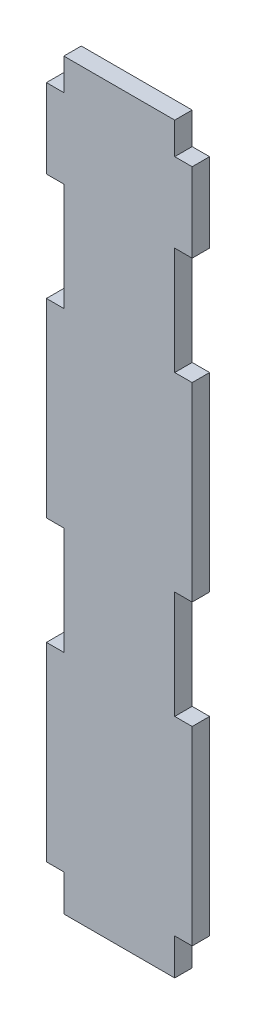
ISO-10303-21;
HEADER;
FILE_DESCRIPTION(('STEP AP214'),'2;1');
FILE_NAME('part.step','',(''),(''),'','','');
FILE_SCHEMA(('AUTOMOTIVE_DESIGN { 1 0 10303 214 1 1 1 1 }'));
ENDSEC;
DATA;
#1=APPLICATION_CONTEXT('core data for automotive mechanical design processes');
#2=APPLICATION_PROTOCOL_DEFINITION('international standard','automotive_design',2000,#1);
#3=PRODUCT_CONTEXT('',#1,'mechanical');
#4=PRODUCT('Part','Part','',(#3));
#5=PRODUCT_RELATED_PRODUCT_CATEGORY('part','',(#4));
#6=PRODUCT_DEFINITION_FORMATION('','',#4);
#7=PRODUCT_DEFINITION_CONTEXT('part definition',#1,'design');
#8=PRODUCT_DEFINITION('design','',#6,#7);
#9=PRODUCT_DEFINITION_SHAPE('','',#8);
#10=(LENGTH_UNIT() NAMED_UNIT(*) SI_UNIT(.MILLI.,.METRE.));
#11=(NAMED_UNIT(*) PLANE_ANGLE_UNIT() SI_UNIT($,.RADIAN.));
#12=(NAMED_UNIT(*) SI_UNIT($,.STERADIAN.) SOLID_ANGLE_UNIT());
#13=UNCERTAINTY_MEASURE_WITH_UNIT(LENGTH_MEASURE(1.E-05),#10,'distance_accuracy_value','');
#14=(GEOMETRIC_REPRESENTATION_CONTEXT(3) GLOBAL_UNCERTAINTY_ASSIGNED_CONTEXT((#13)) GLOBAL_UNIT_ASSIGNED_CONTEXT((#10,
#11,#12)) REPRESENTATION_CONTEXT('',''));
#15=CARTESIAN_POINT('',(0.,0.,0.));
#16=DIRECTION('',(0.,0.,1.));
#17=DIRECTION('',(1.,0.,0.));
#18=AXIS2_PLACEMENT_3D('',#15,#16,#17);
#19=CARTESIAN_POINT('',(17.7551737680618,-117.377586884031,5.5));
#20=DIRECTION('',(0.,1.,0.));
#21=DIRECTION('',(0.,0.,1.));
#22=AXIS2_PLACEMENT_3D('',#19,#20,#21);
#23=PLANE('',#22);
#24=DIRECTION('',(1.,0.,0.));
#25=VECTOR('',#24,1.);
#26=CARTESIAN_POINT('',(17.7551737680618,-117.377586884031,0.));
#27=LINE('',#26,#25);
#28=CARTESIAN_POINT('',(-17.2448262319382,-117.377586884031,0.));
#29=VERTEX_POINT('',#28);
#30=CARTESIAN_POINT('',(17.7551737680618,-117.377586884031,0.));
#31=VERTEX_POINT('',#30);
#32=EDGE_CURVE('E257',#29,#31,#27,.T.);
#33=ORIENTED_EDGE('',*,*,#32,.T.);
#34=DIRECTION('',(0.,0.,-1.));
#35=VECTOR('',#34,1.);
#36=CARTESIAN_POINT('',(17.7551737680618,-117.377586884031,5.5));
#37=LINE('',#36,#35);
#38=CARTESIAN_POINT('',(17.7551737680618,-117.377586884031,5.5));
#39=VERTEX_POINT('',#38);
#40=EDGE_CURVE('E11',#39,#31,#37,.T.);
#41=ORIENTED_EDGE('',*,*,#40,.F.);
#42=DIRECTION('',(1.,0.,0.));
#43=VECTOR('',#42,1.);
#44=CARTESIAN_POINT('',(17.7551737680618,-117.377586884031,5.5));
#45=LINE('',#44,#43);
#46=CARTESIAN_POINT('',(-17.2448262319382,-117.377586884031,5.5));
#47=VERTEX_POINT('',#46);
#48=EDGE_CURVE('E311',#47,#39,#45,.T.);
#49=ORIENTED_EDGE('',*,*,#48,.F.);
#50=DIRECTION('',(0.,0.,-1.));
#51=VECTOR('',#50,1.);
#52=CARTESIAN_POINT('',(-17.2448262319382,-117.377586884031,5.5));
#53=LINE('',#52,#51);
#54=EDGE_CURVE('E253',#47,#29,#53,.T.);
#55=ORIENTED_EDGE('',*,*,#54,.T.);
#56=EDGE_LOOP('',(#33,#41,#49,#55));
#57=FACE_BOUND('',#56,.T.);
#58=ADVANCED_FACE('F41',(#57),#23,.F.);
#59=CARTESIAN_POINT('',(17.7551737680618,-117.377586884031,5.5));
#60=DIRECTION('',(-1.,0.,0.));
#61=DIRECTION('',(0.,0.,1.));
#62=AXIS2_PLACEMENT_3D('',#59,#60,#61);
#63=PLANE('',#62);
#64=DIRECTION('',(0.,1.,0.));
#65=VECTOR('',#64,1.);
#66=CARTESIAN_POINT('',(17.7551737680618,-117.377586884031,0.));
#67=LINE('',#66,#65);
#68=CARTESIAN_POINT('',(17.7551737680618,-105.877586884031,0.));
#69=VERTEX_POINT('',#68);
#70=EDGE_CURVE('E260',#31,#69,#67,.T.);
#71=ORIENTED_EDGE('',*,*,#70,.T.);
#72=DIRECTION('',(0.,0.,-1.));
#73=VECTOR('',#72,1.);
#74=CARTESIAN_POINT('',(17.7551737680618,-105.877586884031,5.5));
#75=LINE('',#74,#73);
#76=CARTESIAN_POINT('',(17.7551737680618,-105.877586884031,5.5));
#77=VERTEX_POINT('',#76);
#78=EDGE_CURVE('E49',#77,#69,#75,.T.);
#79=ORIENTED_EDGE('',*,*,#78,.F.);
#80=DIRECTION('',(0.,1.,0.));
#81=VECTOR('',#80,1.);
#82=CARTESIAN_POINT('',(17.7551737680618,-117.377586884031,5.5));
#83=LINE('',#82,#81);
#84=EDGE_CURVE('E160',#39,#77,#83,.T.);
#85=ORIENTED_EDGE('',*,*,#84,.F.);
#86=ORIENTED_EDGE('',*,*,#40,.T.);
#87=EDGE_LOOP('',(#71,#79,#85,#86));
#88=FACE_BOUND('',#87,.T.);
#89=ADVANCED_FACE('F469',(#88),#63,.F.);
#90=CARTESIAN_POINT('',(23.2551737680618,-105.877586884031,5.5));
#91=DIRECTION('',(0.,1.,0.));
#92=DIRECTION('',(0.,0.,1.));
#93=AXIS2_PLACEMENT_3D('',#90,#91,#92);
#94=PLANE('',#93);
#95=DIRECTION('',(1.,0.,0.));
#96=VECTOR('',#95,1.);
#97=CARTESIAN_POINT('',(23.2551737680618,-105.877586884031,0.));
#98=LINE('',#97,#96);
#99=CARTESIAN_POINT('',(23.2551737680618,-105.877586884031,0.));
#100=VERTEX_POINT('',#99);
#101=EDGE_CURVE('E262',#69,#100,#98,.T.);
#102=ORIENTED_EDGE('',*,*,#101,.T.);
#103=DIRECTION('',(0.,0.,-1.));
#104=VECTOR('',#103,1.);
#105=CARTESIAN_POINT('',(23.2551737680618,-105.877586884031,5.5));
#106=LINE('',#105,#104);
#107=CARTESIAN_POINT('',(23.2551737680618,-105.877586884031,5.5));
#108=VERTEX_POINT('',#107);
#109=EDGE_CURVE('E378',#108,#100,#106,.T.);
#110=ORIENTED_EDGE('',*,*,#109,.F.);
#111=DIRECTION('',(1.,0.,0.));
#112=VECTOR('',#111,1.);
#113=CARTESIAN_POINT('',(23.2551737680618,-105.877586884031,5.5));
#114=LINE('',#113,#112);
#115=EDGE_CURVE('E386',#77,#108,#114,.T.);
#116=ORIENTED_EDGE('',*,*,#115,.F.);
#117=ORIENTED_EDGE('',*,*,#78,.T.);
#118=EDGE_LOOP('',(#102,#110,#116,#117));
#119=FACE_BOUND('',#118,.T.);
#120=ADVANCED_FACE('F384',(#119),#94,.F.);
#121=CARTESIAN_POINT('',(23.2551737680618,-45.8775868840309,5.5));
#122=DIRECTION('',(-1.,0.,0.));
#123=DIRECTION('',(0.,0.,1.));
#124=AXIS2_PLACEMENT_3D('',#121,#122,#123);
#125=PLANE('',#124);
#126=DIRECTION('',(0.,1.,0.));
#127=VECTOR('',#126,1.);
#128=CARTESIAN_POINT('',(23.2551737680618,-45.8775868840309,0.));
#129=LINE('',#128,#127);
#130=CARTESIAN_POINT('',(23.2551737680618,-45.8775868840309,0.));
#131=VERTEX_POINT('',#130);
#132=EDGE_CURVE('E264',#100,#131,#129,.T.);
#133=ORIENTED_EDGE('',*,*,#132,.T.);
#134=DIRECTION('',(0.,0.,-1.));
#135=VECTOR('',#134,1.);
#136=CARTESIAN_POINT('',(23.2551737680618,-45.8775868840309,5.5));
#137=LINE('',#136,#135);
#138=CARTESIAN_POINT('',(23.2551737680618,-45.8775868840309,5.5));
#139=VERTEX_POINT('',#138);
#140=EDGE_CURVE('E375',#139,#131,#137,.T.);
#141=ORIENTED_EDGE('',*,*,#140,.F.);
#142=DIRECTION('',(0.,1.,0.));
#143=VECTOR('',#142,1.);
#144=CARTESIAN_POINT('',(23.2551737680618,-45.8775868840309,5.5));
#145=LINE('',#144,#143);
#146=EDGE_CURVE('E404',#108,#139,#145,.T.);
#147=ORIENTED_EDGE('',*,*,#146,.F.);
#148=ORIENTED_EDGE('',*,*,#109,.T.);
#149=EDGE_LOOP('',(#133,#141,#147,#148));
#150=FACE_BOUND('',#149,.T.);
#151=ADVANCED_FACE('F395',(#150),#125,.F.);
#152=CARTESIAN_POINT('',(17.7551737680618,-45.8775868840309,5.5));
#153=DIRECTION('',(0.,-1.,0.));
#154=DIRECTION('',(0.,0.,-1.));
#155=AXIS2_PLACEMENT_3D('',#152,#153,#154);
#156=PLANE('',#155);
#157=DIRECTION('',(-1.,0.,0.));
#158=VECTOR('',#157,1.);
#159=CARTESIAN_POINT('',(17.7551737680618,-45.8775868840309,0.));
#160=LINE('',#159,#158);
#161=CARTESIAN_POINT('',(17.7551737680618,-45.8775868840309,0.));
#162=VERTEX_POINT('',#161);
#163=EDGE_CURVE('E266',#131,#162,#160,.T.);
#164=ORIENTED_EDGE('',*,*,#163,.T.);
#165=DIRECTION('',(0.,0.,-1.));
#166=VECTOR('',#165,1.);
#167=CARTESIAN_POINT('',(17.7551737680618,-45.8775868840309,5.5));
#168=LINE('',#167,#166);
#169=CARTESIAN_POINT('',(17.7551737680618,-45.8775868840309,5.5));
#170=VERTEX_POINT('',#169);
#171=EDGE_CURVE('E372',#170,#162,#168,.T.);
#172=ORIENTED_EDGE('',*,*,#171,.F.);
#173=DIRECTION('',(-1.,0.,0.));
#174=VECTOR('',#173,1.);
#175=CARTESIAN_POINT('',(17.7551737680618,-45.8775868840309,5.5));
#176=LINE('',#175,#174);
#177=EDGE_CURVE('E401',#139,#170,#176,.T.);
#178=ORIENTED_EDGE('',*,*,#177,.F.);
#179=ORIENTED_EDGE('',*,*,#140,.T.);
#180=EDGE_LOOP('',(#164,#172,#178,#179));
#181=FACE_BOUND('',#180,.T.);
#182=ADVANCED_FACE('F399',(#181),#156,.F.);
#183=CARTESIAN_POINT('',(17.7551737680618,-45.8775868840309,5.5));
#184=DIRECTION('',(-1.,0.,0.));
#185=DIRECTION('',(0.,0.,1.));
#186=AXIS2_PLACEMENT_3D('',#183,#184,#185);
#187=PLANE('',#186);
#188=DIRECTION('',(0.,1.,0.));
#189=VECTOR('',#188,1.);
#190=CARTESIAN_POINT('',(17.7551737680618,-45.8775868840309,0.));
#191=LINE('',#190,#189);
#192=CARTESIAN_POINT('',(17.7551737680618,-11.8775868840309,0.));
#193=VERTEX_POINT('',#192);
#194=EDGE_CURVE('E268',#162,#193,#191,.T.);
#195=ORIENTED_EDGE('',*,*,#194,.T.);
#196=DIRECTION('',(0.,0.,-1.));
#197=VECTOR('',#196,1.);
#198=CARTESIAN_POINT('',(17.7551737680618,-11.8775868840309,5.5));
#199=LINE('',#198,#197);
#200=CARTESIAN_POINT('',(17.7551737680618,-11.8775868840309,5.5));
#201=VERTEX_POINT('',#200);
#202=EDGE_CURVE('E369',#201,#193,#199,.T.);
#203=ORIENTED_EDGE('',*,*,#202,.F.);
#204=DIRECTION('',(0.,1.,0.));
#205=VECTOR('',#204,1.);
#206=CARTESIAN_POINT('',(17.7551737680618,-45.8775868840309,5.5));
#207=LINE('',#206,#205);
#208=EDGE_CURVE('E403',#170,#201,#207,.T.);
#209=ORIENTED_EDGE('',*,*,#208,.F.);
#210=ORIENTED_EDGE('',*,*,#171,.T.);
#211=EDGE_LOOP('',(#195,#203,#209,#210));
#212=FACE_BOUND('',#211,.T.);
#213=ADVANCED_FACE('F482',(#212),#187,.F.);
#214=CARTESIAN_POINT('',(23.2551737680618,-11.8775868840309,5.5));
#215=DIRECTION('',(0.,1.,0.));
#216=DIRECTION('',(0.,0.,1.));
#217=AXIS2_PLACEMENT_3D('',#214,#215,#216);
#218=PLANE('',#217);
#219=DIRECTION('',(1.,0.,0.));
#220=VECTOR('',#219,1.);
#221=CARTESIAN_POINT('',(23.2551737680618,-11.8775868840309,0.));
#222=LINE('',#221,#220);
#223=CARTESIAN_POINT('',(23.2551737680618,-11.8775868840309,0.));
#224=VERTEX_POINT('',#223);
#225=EDGE_CURVE('E270',#193,#224,#222,.T.);
#226=ORIENTED_EDGE('',*,*,#225,.T.);
#227=DIRECTION('',(0.,0.,-1.));
#228=VECTOR('',#227,1.);
#229=CARTESIAN_POINT('',(23.2551737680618,-11.8775868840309,5.5));
#230=LINE('',#229,#228);
#231=CARTESIAN_POINT('',(23.2551737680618,-11.8775868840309,5.5));
#232=VERTEX_POINT('',#231);
#233=EDGE_CURVE('E366',#232,#224,#230,.T.);
#234=ORIENTED_EDGE('',*,*,#233,.F.);
#235=DIRECTION('',(1.,0.,0.));
#236=VECTOR('',#235,1.);
#237=CARTESIAN_POINT('',(23.2551737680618,-11.8775868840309,5.5));
#238=LINE('',#237,#236);
#239=EDGE_CURVE('E406',#201,#232,#238,.T.);
#240=ORIENTED_EDGE('',*,*,#239,.F.);
#241=ORIENTED_EDGE('',*,*,#202,.T.);
#242=EDGE_LOOP('',(#226,#234,#240,#241));
#243=FACE_BOUND('',#242,.T.);
#244=ADVANCED_FACE('F485',(#243),#218,.F.);
#245=CARTESIAN_POINT('',(23.2551737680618,48.1224131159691,5.5));
#246=DIRECTION('',(-1.,0.,0.));
#247=DIRECTION('',(0.,0.,1.));
#248=AXIS2_PLACEMENT_3D('',#245,#246,#247);
#249=PLANE('',#248);
#250=DIRECTION('',(0.,1.,0.));
#251=VECTOR('',#250,1.);
#252=CARTESIAN_POINT('',(23.2551737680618,48.1224131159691,0.));
#253=LINE('',#252,#251);
#254=CARTESIAN_POINT('',(23.2551737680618,48.1224131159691,0.));
#255=VERTEX_POINT('',#254);
#256=EDGE_CURVE('E272',#224,#255,#253,.T.);
#257=ORIENTED_EDGE('',*,*,#256,.T.);
#258=DIRECTION('',(0.,0.,-1.));
#259=VECTOR('',#258,1.);
#260=CARTESIAN_POINT('',(23.2551737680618,48.1224131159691,5.5));
#261=LINE('',#260,#259);
#262=CARTESIAN_POINT('',(23.2551737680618,48.1224131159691,5.5));
#263=VERTEX_POINT('',#262);
#264=EDGE_CURVE('E363',#263,#255,#261,.T.);
#265=ORIENTED_EDGE('',*,*,#264,.F.);
#266=DIRECTION('',(0.,1.,0.));
#267=VECTOR('',#266,1.);
#268=CARTESIAN_POINT('',(23.2551737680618,48.1224131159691,5.5));
#269=LINE('',#268,#267);
#270=EDGE_CURVE('E412',#232,#263,#269,.T.);
#271=ORIENTED_EDGE('',*,*,#270,.F.);
#272=ORIENTED_EDGE('',*,*,#233,.T.);
#273=EDGE_LOOP('',(#257,#265,#271,#272));
#274=FACE_BOUND('',#273,.T.);
#275=ADVANCED_FACE('F489',(#274),#249,.F.);
#276=CARTESIAN_POINT('',(17.7551737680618,48.1224131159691,5.5));
#277=DIRECTION('',(0.,-1.,0.));
#278=DIRECTION('',(0.,0.,-1.));
#279=AXIS2_PLACEMENT_3D('',#276,#277,#278);
#280=PLANE('',#279);
#281=DIRECTION('',(-1.,0.,0.));
#282=VECTOR('',#281,1.);
#283=CARTESIAN_POINT('',(17.7551737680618,48.1224131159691,0.));
#284=LINE('',#283,#282);
#285=CARTESIAN_POINT('',(17.7551737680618,48.1224131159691,0.));
#286=VERTEX_POINT('',#285);
#287=EDGE_CURVE('E274',#255,#286,#284,.T.);
#288=ORIENTED_EDGE('',*,*,#287,.T.);
#289=DIRECTION('',(0.,0.,-1.));
#290=VECTOR('',#289,1.);
#291=CARTESIAN_POINT('',(17.7551737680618,48.1224131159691,5.5));
#292=LINE('',#291,#290);
#293=CARTESIAN_POINT('',(17.7551737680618,48.1224131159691,5.5));
#294=VERTEX_POINT('',#293);
#295=EDGE_CURVE('E360',#294,#286,#292,.T.);
#296=ORIENTED_EDGE('',*,*,#295,.F.);
#297=DIRECTION('',(-1.,0.,0.));
#298=VECTOR('',#297,1.);
#299=CARTESIAN_POINT('',(17.7551737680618,48.1224131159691,5.5));
#300=LINE('',#299,#298);
#301=EDGE_CURVE('E414',#263,#294,#300,.T.);
#302=ORIENTED_EDGE('',*,*,#301,.F.);
#303=ORIENTED_EDGE('',*,*,#264,.T.);
#304=EDGE_LOOP('',(#288,#296,#302,#303));
#305=FACE_BOUND('',#304,.T.);
#306=ADVANCED_FACE('F493',(#305),#280,.F.);
#307=CARTESIAN_POINT('',(17.7551737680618,82.1224131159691,5.5));
#308=DIRECTION('',(-1.,0.,0.));
#309=DIRECTION('',(0.,0.,1.));
#310=AXIS2_PLACEMENT_3D('',#307,#308,#309);
#311=PLANE('',#310);
#312=DIRECTION('',(0.,1.,0.));
#313=VECTOR('',#312,1.);
#314=CARTESIAN_POINT('',(17.7551737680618,82.1224131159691,0.));
#315=LINE('',#314,#313);
#316=CARTESIAN_POINT('',(17.7551737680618,82.1224131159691,0.));
#317=VERTEX_POINT('',#316);
#318=EDGE_CURVE('E276',#286,#317,#315,.T.);
#319=ORIENTED_EDGE('',*,*,#318,.T.);
#320=DIRECTION('',(0.,0.,-1.));
#321=VECTOR('',#320,1.);
#322=CARTESIAN_POINT('',(17.7551737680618,82.1224131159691,5.5));
#323=LINE('',#322,#321);
#324=CARTESIAN_POINT('',(17.7551737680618,82.1224131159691,5.5));
#325=VERTEX_POINT('',#324);
#326=EDGE_CURVE('E357',#325,#317,#323,.T.);
#327=ORIENTED_EDGE('',*,*,#326,.F.);
#328=DIRECTION('',(0.,1.,0.));
#329=VECTOR('',#328,1.);
#330=CARTESIAN_POINT('',(17.7551737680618,82.1224131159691,5.5));
#331=LINE('',#330,#329);
#332=EDGE_CURVE('E416',#294,#325,#331,.T.);
#333=ORIENTED_EDGE('',*,*,#332,.F.);
#334=ORIENTED_EDGE('',*,*,#295,.T.);
#335=EDGE_LOOP('',(#319,#327,#333,#334));
#336=FACE_BOUND('',#335,.T.);
#337=ADVANCED_FACE('F497',(#336),#311,.F.);
#338=CARTESIAN_POINT('',(23.2551737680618,82.1224131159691,5.5));
#339=DIRECTION('',(0.,1.,0.));
#340=DIRECTION('',(0.,0.,1.));
#341=AXIS2_PLACEMENT_3D('',#338,#339,#340);
#342=PLANE('',#341);
#343=DIRECTION('',(1.,0.,0.));
#344=VECTOR('',#343,1.);
#345=CARTESIAN_POINT('',(23.2551737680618,82.1224131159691,0.));
#346=LINE('',#345,#344);
#347=CARTESIAN_POINT('',(23.2551737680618,82.1224131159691,0.));
#348=VERTEX_POINT('',#347);
#349=EDGE_CURVE('E278',#317,#348,#346,.T.);
#350=ORIENTED_EDGE('',*,*,#349,.T.);
#351=DIRECTION('',(0.,0.,-1.));
#352=VECTOR('',#351,1.);
#353=CARTESIAN_POINT('',(23.2551737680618,82.1224131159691,5.5));
#354=LINE('',#353,#352);
#355=CARTESIAN_POINT('',(23.2551737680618,82.1224131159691,5.5));
#356=VERTEX_POINT('',#355);
#357=EDGE_CURVE('E354',#356,#348,#354,.T.);
#358=ORIENTED_EDGE('',*,*,#357,.F.);
#359=DIRECTION('',(1.,0.,0.));
#360=VECTOR('',#359,1.);
#361=CARTESIAN_POINT('',(23.2551737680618,82.1224131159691,5.5));
#362=LINE('',#361,#360);
#363=EDGE_CURVE('E418',#325,#356,#362,.T.);
#364=ORIENTED_EDGE('',*,*,#363,.F.);
#365=ORIENTED_EDGE('',*,*,#326,.T.);
#366=EDGE_LOOP('',(#350,#358,#364,#365));
#367=FACE_BOUND('',#366,.T.);
#368=ADVANCED_FACE('F501',(#367),#342,.F.);
#369=CARTESIAN_POINT('',(23.2551737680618,107.122413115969,5.5));
#370=DIRECTION('',(-1.,0.,0.));
#371=DIRECTION('',(0.,0.,1.));
#372=AXIS2_PLACEMENT_3D('',#369,#370,#371);
#373=PLANE('',#372);
#374=DIRECTION('',(0.,1.,0.));
#375=VECTOR('',#374,1.);
#376=CARTESIAN_POINT('',(23.2551737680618,107.122413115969,0.));
#377=LINE('',#376,#375);
#378=CARTESIAN_POINT('',(23.2551737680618,107.122413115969,0.));
#379=VERTEX_POINT('',#378);
#380=EDGE_CURVE('E280',#348,#379,#377,.T.);
#381=ORIENTED_EDGE('',*,*,#380,.T.);
#382=DIRECTION('',(0.,0.,-1.));
#383=VECTOR('',#382,1.);
#384=CARTESIAN_POINT('',(23.2551737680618,107.122413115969,5.5));
#385=LINE('',#384,#383);
#386=CARTESIAN_POINT('',(23.2551737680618,107.122413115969,5.5));
#387=VERTEX_POINT('',#386);
#388=EDGE_CURVE('E351',#387,#379,#385,.T.);
#389=ORIENTED_EDGE('',*,*,#388,.F.);
#390=DIRECTION('',(0.,1.,0.));
#391=VECTOR('',#390,1.);
#392=CARTESIAN_POINT('',(23.2551737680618,107.122413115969,5.5));
#393=LINE('',#392,#391);
#394=EDGE_CURVE('E420',#356,#387,#393,.T.);
#395=ORIENTED_EDGE('',*,*,#394,.F.);
#396=ORIENTED_EDGE('',*,*,#357,.T.);
#397=EDGE_LOOP('',(#381,#389,#395,#396));
#398=FACE_BOUND('',#397,.T.);
#399=ADVANCED_FACE('F505',(#398),#373,.F.);
#400=CARTESIAN_POINT('',(17.7551737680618,107.122413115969,5.5));
#401=DIRECTION('',(0.,-1.,0.));
#402=DIRECTION('',(0.,0.,-1.));
#403=AXIS2_PLACEMENT_3D('',#400,#401,#402);
#404=PLANE('',#403);
#405=DIRECTION('',(-1.,0.,0.));
#406=VECTOR('',#405,1.);
#407=CARTESIAN_POINT('',(17.7551737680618,107.122413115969,0.));
#408=LINE('',#407,#406);
#409=CARTESIAN_POINT('',(17.7551737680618,107.122413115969,0.));
#410=VERTEX_POINT('',#409);
#411=EDGE_CURVE('E282',#379,#410,#408,.T.);
#412=ORIENTED_EDGE('',*,*,#411,.T.);
#413=DIRECTION('',(0.,0.,-1.));
#414=VECTOR('',#413,1.);
#415=CARTESIAN_POINT('',(17.7551737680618,107.122413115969,5.5));
#416=LINE('',#415,#414);
#417=CARTESIAN_POINT('',(17.7551737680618,107.122413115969,5.5));
#418=VERTEX_POINT('',#417);
#419=EDGE_CURVE('E348',#418,#410,#416,.T.);
#420=ORIENTED_EDGE('',*,*,#419,.F.);
#421=DIRECTION('',(-1.,0.,0.));
#422=VECTOR('',#421,1.);
#423=CARTESIAN_POINT('',(17.7551737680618,107.122413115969,5.5));
#424=LINE('',#423,#422);
#425=EDGE_CURVE('E422',#387,#418,#424,.T.);
#426=ORIENTED_EDGE('',*,*,#425,.F.);
#427=ORIENTED_EDGE('',*,*,#388,.T.);
#428=EDGE_LOOP('',(#412,#420,#426,#427));
#429=FACE_BOUND('',#428,.T.);
#430=ADVANCED_FACE('F509',(#429),#404,.F.);
#431=CARTESIAN_POINT('',(17.7551737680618,117.122413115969,5.5));
#432=DIRECTION('',(-1.,0.,0.));
#433=DIRECTION('',(0.,0.,1.));
#434=AXIS2_PLACEMENT_3D('',#431,#432,#433);
#435=PLANE('',#434);
#436=DIRECTION('',(0.,1.,0.));
#437=VECTOR('',#436,1.);
#438=CARTESIAN_POINT('',(17.7551737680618,117.122413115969,0.));
#439=LINE('',#438,#437);
#440=CARTESIAN_POINT('',(17.7551737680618,117.122413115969,0.));
#441=VERTEX_POINT('',#440);
#442=EDGE_CURVE('E284',#410,#441,#439,.T.);
#443=ORIENTED_EDGE('',*,*,#442,.T.);
#444=DIRECTION('',(0.,0.,-1.));
#445=VECTOR('',#444,1.);
#446=CARTESIAN_POINT('',(17.7551737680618,117.122413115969,5.5));
#447=LINE('',#446,#445);
#448=CARTESIAN_POINT('',(17.7551737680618,117.122413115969,5.5));
#449=VERTEX_POINT('',#448);
#450=EDGE_CURVE('E345',#449,#441,#447,.T.);
#451=ORIENTED_EDGE('',*,*,#450,.F.);
#452=DIRECTION('',(0.,1.,0.));
#453=VECTOR('',#452,1.);
#454=CARTESIAN_POINT('',(17.7551737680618,117.122413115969,5.5));
#455=LINE('',#454,#453);
#456=EDGE_CURVE('E424',#418,#449,#455,.T.);
#457=ORIENTED_EDGE('',*,*,#456,.F.);
#458=ORIENTED_EDGE('',*,*,#419,.T.);
#459=EDGE_LOOP('',(#443,#451,#457,#458));
#460=FACE_BOUND('',#459,.T.);
#461=ADVANCED_FACE('F513',(#460),#435,.F.);
#462=CARTESIAN_POINT('',(-17.2448262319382,117.122413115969,5.5));
#463=DIRECTION('',(0.,-1.,0.));
#464=DIRECTION('',(0.,0.,-1.));
#465=AXIS2_PLACEMENT_3D('',#462,#463,#464);
#466=PLANE('',#465);
#467=DIRECTION('',(-1.,0.,0.));
#468=VECTOR('',#467,1.);
#469=CARTESIAN_POINT('',(-17.2448262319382,117.122413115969,0.));
#470=LINE('',#469,#468);
#471=CARTESIAN_POINT('',(-17.2448262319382,117.122413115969,0.));
#472=VERTEX_POINT('',#471);
#473=EDGE_CURVE('E286',#441,#472,#470,.T.);
#474=ORIENTED_EDGE('',*,*,#473,.T.);
#475=DIRECTION('',(0.,0.,-1.));
#476=VECTOR('',#475,1.);
#477=CARTESIAN_POINT('',(-17.2448262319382,117.122413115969,5.5));
#478=LINE('',#477,#476);
#479=CARTESIAN_POINT('',(-17.2448262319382,117.122413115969,5.5));
#480=VERTEX_POINT('',#479);
#481=EDGE_CURVE('E342',#480,#472,#478,.T.);
#482=ORIENTED_EDGE('',*,*,#481,.F.);
#483=DIRECTION('',(-1.,0.,0.));
#484=VECTOR('',#483,1.);
#485=CARTESIAN_POINT('',(-17.2448262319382,117.122413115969,5.5));
#486=LINE('',#485,#484);
#487=EDGE_CURVE('E426',#449,#480,#486,.T.);
#488=ORIENTED_EDGE('',*,*,#487,.F.);
#489=ORIENTED_EDGE('',*,*,#450,.T.);
#490=EDGE_LOOP('',(#474,#482,#488,#489));
#491=FACE_BOUND('',#490,.T.);
#492=ADVANCED_FACE('F517',(#491),#466,.F.);
#493=CARTESIAN_POINT('',(-17.2448262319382,107.122413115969,5.5));
#494=DIRECTION('',(1.,0.,0.));
#495=DIRECTION('',(0.,0.,-1.));
#496=AXIS2_PLACEMENT_3D('',#493,#494,#495);
#497=PLANE('',#496);
#498=DIRECTION('',(0.,-1.,0.));
#499=VECTOR('',#498,1.);
#500=CARTESIAN_POINT('',(-17.2448262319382,107.122413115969,0.));
#501=LINE('',#500,#499);
#502=CARTESIAN_POINT('',(-17.2448262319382,107.122413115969,0.));
#503=VERTEX_POINT('',#502);
#504=EDGE_CURVE('E288',#472,#503,#501,.T.);
#505=ORIENTED_EDGE('',*,*,#504,.T.);
#506=DIRECTION('',(0.,0.,-1.));
#507=VECTOR('',#506,1.);
#508=CARTESIAN_POINT('',(-17.2448262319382,107.122413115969,5.5));
#509=LINE('',#508,#507);
#510=CARTESIAN_POINT('',(-17.2448262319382,107.122413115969,5.5));
#511=VERTEX_POINT('',#510);
#512=EDGE_CURVE('E339',#511,#503,#509,.T.);
#513=ORIENTED_EDGE('',*,*,#512,.F.);
#514=DIRECTION('',(0.,-1.,0.));
#515=VECTOR('',#514,1.);
#516=CARTESIAN_POINT('',(-17.2448262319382,107.122413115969,5.5));
#517=LINE('',#516,#515);
#518=EDGE_CURVE('E428',#480,#511,#517,.T.);
#519=ORIENTED_EDGE('',*,*,#518,.F.);
#520=ORIENTED_EDGE('',*,*,#481,.T.);
#521=EDGE_LOOP('',(#505,#513,#519,#520));
#522=FACE_BOUND('',#521,.T.);
#523=ADVANCED_FACE('F521',(#522),#497,.F.);
#524=CARTESIAN_POINT('',(-22.7448262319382,107.122413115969,5.5));
#525=DIRECTION('',(0.,-1.,0.));
#526=DIRECTION('',(0.,0.,-1.));
#527=AXIS2_PLACEMENT_3D('',#524,#525,#526);
#528=PLANE('',#527);
#529=DIRECTION('',(-1.,0.,0.));
#530=VECTOR('',#529,1.);
#531=CARTESIAN_POINT('',(-22.7448262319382,107.122413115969,0.));
#532=LINE('',#531,#530);
#533=CARTESIAN_POINT('',(-22.7448262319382,107.122413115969,0.));
#534=VERTEX_POINT('',#533);
#535=EDGE_CURVE('E290',#503,#534,#532,.T.);
#536=ORIENTED_EDGE('',*,*,#535,.T.);
#537=DIRECTION('',(0.,0.,-1.));
#538=VECTOR('',#537,1.);
#539=CARTESIAN_POINT('',(-22.7448262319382,107.122413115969,5.5));
#540=LINE('',#539,#538);
#541=CARTESIAN_POINT('',(-22.7448262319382,107.122413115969,5.5));
#542=VERTEX_POINT('',#541);
#543=EDGE_CURVE('E336',#542,#534,#540,.T.);
#544=ORIENTED_EDGE('',*,*,#543,.F.);
#545=DIRECTION('',(-1.,0.,0.));
#546=VECTOR('',#545,1.);
#547=CARTESIAN_POINT('',(-22.7448262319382,107.122413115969,5.5));
#548=LINE('',#547,#546);
#549=EDGE_CURVE('E430',#511,#542,#548,.T.);
#550=ORIENTED_EDGE('',*,*,#549,.F.);
#551=ORIENTED_EDGE('',*,*,#512,.T.);
#552=EDGE_LOOP('',(#536,#544,#550,#551));
#553=FACE_BOUND('',#552,.T.);
#554=ADVANCED_FACE('F525',(#553),#528,.F.);
#555=CARTESIAN_POINT('',(-22.7448262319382,82.1224131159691,5.5));
#556=DIRECTION('',(1.,0.,0.));
#557=DIRECTION('',(0.,0.,-1.));
#558=AXIS2_PLACEMENT_3D('',#555,#556,#557);
#559=PLANE('',#558);
#560=DIRECTION('',(0.,-1.,0.));
#561=VECTOR('',#560,1.);
#562=CARTESIAN_POINT('',(-22.7448262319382,82.1224131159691,0.));
#563=LINE('',#562,#561);
#564=CARTESIAN_POINT('',(-22.7448262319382,82.1224131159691,0.));
#565=VERTEX_POINT('',#564);
#566=EDGE_CURVE('E292',#534,#565,#563,.T.);
#567=ORIENTED_EDGE('',*,*,#566,.T.);
#568=DIRECTION('',(0.,0.,-1.));
#569=VECTOR('',#568,1.);
#570=CARTESIAN_POINT('',(-22.7448262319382,82.1224131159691,5.5));
#571=LINE('',#570,#569);
#572=CARTESIAN_POINT('',(-22.7448262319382,82.1224131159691,5.5));
#573=VERTEX_POINT('',#572);
#574=EDGE_CURVE('E333',#573,#565,#571,.T.);
#575=ORIENTED_EDGE('',*,*,#574,.F.);
#576=DIRECTION('',(0.,-1.,0.));
#577=VECTOR('',#576,1.);
#578=CARTESIAN_POINT('',(-22.7448262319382,82.1224131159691,5.5));
#579=LINE('',#578,#577);
#580=EDGE_CURVE('E432',#542,#573,#579,.T.);
#581=ORIENTED_EDGE('',*,*,#580,.F.);
#582=ORIENTED_EDGE('',*,*,#543,.T.);
#583=EDGE_LOOP('',(#567,#575,#581,#582));
#584=FACE_BOUND('',#583,.T.);
#585=ADVANCED_FACE('F529',(#584),#559,.F.);
#586=CARTESIAN_POINT('',(-17.2448262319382,82.1224131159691,5.5));
#587=DIRECTION('',(0.,1.,0.));
#588=DIRECTION('',(0.,0.,1.));
#589=AXIS2_PLACEMENT_3D('',#586,#587,#588);
#590=PLANE('',#589);
#591=DIRECTION('',(1.,0.,0.));
#592=VECTOR('',#591,1.);
#593=CARTESIAN_POINT('',(-17.2448262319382,82.1224131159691,0.));
#594=LINE('',#593,#592);
#595=CARTESIAN_POINT('',(-17.2448262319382,82.1224131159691,0.));
#596=VERTEX_POINT('',#595);
#597=EDGE_CURVE('E294',#565,#596,#594,.T.);
#598=ORIENTED_EDGE('',*,*,#597,.T.);
#599=DIRECTION('',(0.,0.,-1.));
#600=VECTOR('',#599,1.);
#601=CARTESIAN_POINT('',(-17.2448262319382,82.1224131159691,5.5));
#602=LINE('',#601,#600);
#603=CARTESIAN_POINT('',(-17.2448262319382,82.1224131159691,5.5));
#604=VERTEX_POINT('',#603);
#605=EDGE_CURVE('E330',#604,#596,#602,.T.);
#606=ORIENTED_EDGE('',*,*,#605,.F.);
#607=DIRECTION('',(1.,0.,0.));
#608=VECTOR('',#607,1.);
#609=CARTESIAN_POINT('',(-17.2448262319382,82.1224131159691,5.5));
#610=LINE('',#609,#608);
#611=EDGE_CURVE('E434',#573,#604,#610,.T.);
#612=ORIENTED_EDGE('',*,*,#611,.F.);
#613=ORIENTED_EDGE('',*,*,#574,.T.);
#614=EDGE_LOOP('',(#598,#606,#612,#613));
#615=FACE_BOUND('',#614,.T.);
#616=ADVANCED_FACE('F533',(#615),#590,.F.);
#617=CARTESIAN_POINT('',(-17.2448262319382,48.1224131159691,5.5));
#618=DIRECTION('',(1.,0.,0.));
#619=DIRECTION('',(0.,0.,-1.));
#620=AXIS2_PLACEMENT_3D('',#617,#618,#619);
#621=PLANE('',#620);
#622=DIRECTION('',(0.,-1.,0.));
#623=VECTOR('',#622,1.);
#624=CARTESIAN_POINT('',(-17.2448262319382,48.1224131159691,0.));
#625=LINE('',#624,#623);
#626=CARTESIAN_POINT('',(-17.2448262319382,48.1224131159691,0.));
#627=VERTEX_POINT('',#626);
#628=EDGE_CURVE('E296',#596,#627,#625,.T.);
#629=ORIENTED_EDGE('',*,*,#628,.T.);
#630=DIRECTION('',(0.,0.,-1.));
#631=VECTOR('',#630,1.);
#632=CARTESIAN_POINT('',(-17.2448262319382,48.1224131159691,5.5));
#633=LINE('',#632,#631);
#634=CARTESIAN_POINT('',(-17.2448262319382,48.1224131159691,5.5));
#635=VERTEX_POINT('',#634);
#636=EDGE_CURVE('E327',#635,#627,#633,.T.);
#637=ORIENTED_EDGE('',*,*,#636,.F.);
#638=DIRECTION('',(0.,-1.,0.));
#639=VECTOR('',#638,1.);
#640=CARTESIAN_POINT('',(-17.2448262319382,48.1224131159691,5.5));
#641=LINE('',#640,#639);
#642=EDGE_CURVE('E436',#604,#635,#641,.T.);
#643=ORIENTED_EDGE('',*,*,#642,.F.);
#644=ORIENTED_EDGE('',*,*,#605,.T.);
#645=EDGE_LOOP('',(#629,#637,#643,#644));
#646=FACE_BOUND('',#645,.T.);
#647=ADVANCED_FACE('F537',(#646),#621,.F.);
#648=CARTESIAN_POINT('',(-22.7448262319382,48.1224131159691,5.5));
#649=DIRECTION('',(0.,-1.,0.));
#650=DIRECTION('',(0.,0.,-1.));
#651=AXIS2_PLACEMENT_3D('',#648,#649,#650);
#652=PLANE('',#651);
#653=DIRECTION('',(-1.,0.,0.));
#654=VECTOR('',#653,1.);
#655=CARTESIAN_POINT('',(-22.7448262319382,48.1224131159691,0.));
#656=LINE('',#655,#654);
#657=CARTESIAN_POINT('',(-22.7448262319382,48.1224131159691,0.));
#658=VERTEX_POINT('',#657);
#659=EDGE_CURVE('E298',#627,#658,#656,.T.);
#660=ORIENTED_EDGE('',*,*,#659,.T.);
#661=DIRECTION('',(0.,0.,-1.));
#662=VECTOR('',#661,1.);
#663=CARTESIAN_POINT('',(-22.7448262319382,48.1224131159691,5.5));
#664=LINE('',#663,#662);
#665=CARTESIAN_POINT('',(-22.7448262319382,48.1224131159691,5.5));
#666=VERTEX_POINT('',#665);
#667=EDGE_CURVE('E324',#666,#658,#664,.T.);
#668=ORIENTED_EDGE('',*,*,#667,.F.);
#669=DIRECTION('',(-1.,0.,0.));
#670=VECTOR('',#669,1.);
#671=CARTESIAN_POINT('',(-22.7448262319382,48.1224131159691,5.5));
#672=LINE('',#671,#670);
#673=EDGE_CURVE('E438',#635,#666,#672,.T.);
#674=ORIENTED_EDGE('',*,*,#673,.F.);
#675=ORIENTED_EDGE('',*,*,#636,.T.);
#676=EDGE_LOOP('',(#660,#668,#674,#675));
#677=FACE_BOUND('',#676,.T.);
#678=ADVANCED_FACE('F541',(#677),#652,.F.);
#679=CARTESIAN_POINT('',(-22.7448262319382,-11.8775868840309,5.5));
#680=DIRECTION('',(1.,0.,0.));
#681=DIRECTION('',(0.,0.,-1.));
#682=AXIS2_PLACEMENT_3D('',#679,#680,#681);
#683=PLANE('',#682);
#684=DIRECTION('',(0.,-1.,0.));
#685=VECTOR('',#684,1.);
#686=CARTESIAN_POINT('',(-22.7448262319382,-11.8775868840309,0.));
#687=LINE('',#686,#685);
#688=CARTESIAN_POINT('',(-22.7448262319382,-11.8775868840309,0.));
#689=VERTEX_POINT('',#688);
#690=EDGE_CURVE('E300',#658,#689,#687,.T.);
#691=ORIENTED_EDGE('',*,*,#690,.T.);
#692=DIRECTION('',(0.,0.,-1.));
#693=VECTOR('',#692,1.);
#694=CARTESIAN_POINT('',(-22.7448262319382,-11.8775868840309,5.5));
#695=LINE('',#694,#693);
#696=CARTESIAN_POINT('',(-22.7448262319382,-11.8775868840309,5.5));
#697=VERTEX_POINT('',#696);
#698=EDGE_CURVE('E321',#697,#689,#695,.T.);
#699=ORIENTED_EDGE('',*,*,#698,.F.);
#700=DIRECTION('',(0.,-1.,0.));
#701=VECTOR('',#700,1.);
#702=CARTESIAN_POINT('',(-22.7448262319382,-11.8775868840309,5.5));
#703=LINE('',#702,#701);
#704=EDGE_CURVE('E440',#666,#697,#703,.T.);
#705=ORIENTED_EDGE('',*,*,#704,.F.);
#706=ORIENTED_EDGE('',*,*,#667,.T.);
#707=EDGE_LOOP('',(#691,#699,#705,#706));
#708=FACE_BOUND('',#707,.T.);
#709=ADVANCED_FACE('F545',(#708),#683,.F.);
#710=CARTESIAN_POINT('',(-17.2448262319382,-11.8775868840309,5.5));
#711=DIRECTION('',(0.,1.,0.));
#712=DIRECTION('',(0.,0.,1.));
#713=AXIS2_PLACEMENT_3D('',#710,#711,#712);
#714=PLANE('',#713);
#715=DIRECTION('',(1.,0.,0.));
#716=VECTOR('',#715,1.);
#717=CARTESIAN_POINT('',(-17.2448262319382,-11.8775868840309,0.));
#718=LINE('',#717,#716);
#719=CARTESIAN_POINT('',(-17.2448262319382,-11.8775868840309,0.));
#720=VERTEX_POINT('',#719);
#721=EDGE_CURVE('E302',#689,#720,#718,.T.);
#722=ORIENTED_EDGE('',*,*,#721,.T.);
#723=DIRECTION('',(0.,0.,-1.));
#724=VECTOR('',#723,1.);
#725=CARTESIAN_POINT('',(-17.2448262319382,-11.8775868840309,5.5));
#726=LINE('',#725,#724);
#727=CARTESIAN_POINT('',(-17.2448262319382,-11.8775868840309,5.5));
#728=VERTEX_POINT('',#727);
#729=EDGE_CURVE('E318',#728,#720,#726,.T.);
#730=ORIENTED_EDGE('',*,*,#729,.F.);
#731=DIRECTION('',(1.,0.,0.));
#732=VECTOR('',#731,1.);
#733=CARTESIAN_POINT('',(-17.2448262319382,-11.8775868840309,5.5));
#734=LINE('',#733,#732);
#735=EDGE_CURVE('E442',#697,#728,#734,.T.);
#736=ORIENTED_EDGE('',*,*,#735,.F.);
#737=ORIENTED_EDGE('',*,*,#698,.T.);
#738=EDGE_LOOP('',(#722,#730,#736,#737));
#739=FACE_BOUND('',#738,.T.);
#740=ADVANCED_FACE('F549',(#739),#714,.F.);
#741=CARTESIAN_POINT('',(-17.2448262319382,-45.8775868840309,5.5));
#742=DIRECTION('',(1.,0.,0.));
#743=DIRECTION('',(0.,0.,-1.));
#744=AXIS2_PLACEMENT_3D('',#741,#742,#743);
#745=PLANE('',#744);
#746=DIRECTION('',(0.,-1.,0.));
#747=VECTOR('',#746,1.);
#748=CARTESIAN_POINT('',(-17.2448262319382,-45.8775868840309,0.));
#749=LINE('',#748,#747);
#750=CARTESIAN_POINT('',(-17.2448262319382,-45.8775868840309,0.));
#751=VERTEX_POINT('',#750);
#752=EDGE_CURVE('E304',#720,#751,#749,.T.);
#753=ORIENTED_EDGE('',*,*,#752,.T.);
#754=DIRECTION('',(0.,0.,-1.));
#755=VECTOR('',#754,1.);
#756=CARTESIAN_POINT('',(-17.2448262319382,-45.8775868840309,5.5));
#757=LINE('',#756,#755);
#758=CARTESIAN_POINT('',(-17.2448262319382,-45.8775868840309,5.5));
#759=VERTEX_POINT('',#758);
#760=EDGE_CURVE('E315',#759,#751,#757,.T.);
#761=ORIENTED_EDGE('',*,*,#760,.F.);
#762=DIRECTION('',(0.,-1.,0.));
#763=VECTOR('',#762,1.);
#764=CARTESIAN_POINT('',(-17.2448262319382,-45.8775868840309,5.5));
#765=LINE('',#764,#763);
#766=EDGE_CURVE('E444',#728,#759,#765,.T.);
#767=ORIENTED_EDGE('',*,*,#766,.F.);
#768=ORIENTED_EDGE('',*,*,#729,.T.);
#769=EDGE_LOOP('',(#753,#761,#767,#768));
#770=FACE_BOUND('',#769,.T.);
#771=ADVANCED_FACE('F450',(#770),#745,.F.);
#772=CARTESIAN_POINT('',(-22.7448262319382,-45.8775868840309,5.5));
#773=DIRECTION('',(0.,-1.,0.));
#774=DIRECTION('',(0.,0.,-1.));
#775=AXIS2_PLACEMENT_3D('',#772,#773,#774);
#776=PLANE('',#775);
#777=DIRECTION('',(-1.,0.,0.));
#778=VECTOR('',#777,1.);
#779=CARTESIAN_POINT('',(-22.7448262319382,-45.8775868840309,0.));
#780=LINE('',#779,#778);
#781=CARTESIAN_POINT('',(-22.7448262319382,-45.8775868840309,0.));
#782=VERTEX_POINT('',#781);
#783=EDGE_CURVE('E306',#751,#782,#780,.T.);
#784=ORIENTED_EDGE('',*,*,#783,.T.);
#785=DIRECTION('',(0.,0.,-1.));
#786=VECTOR('',#785,1.);
#787=CARTESIAN_POINT('',(-22.7448262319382,-45.8775868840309,5.5));
#788=LINE('',#787,#786);
#789=CARTESIAN_POINT('',(-22.7448262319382,-45.8775868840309,5.5));
#790=VERTEX_POINT('',#789);
#791=EDGE_CURVE('E248',#790,#782,#788,.T.);
#792=ORIENTED_EDGE('',*,*,#791,.F.);
#793=DIRECTION('',(-1.,0.,0.));
#794=VECTOR('',#793,1.);
#795=CARTESIAN_POINT('',(-22.7448262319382,-45.8775868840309,5.5));
#796=LINE('',#795,#794);
#797=EDGE_CURVE('E239',#759,#790,#796,.T.);
#798=ORIENTED_EDGE('',*,*,#797,.F.);
#799=ORIENTED_EDGE('',*,*,#760,.T.);
#800=EDGE_LOOP('',(#784,#792,#798,#799));
#801=FACE_BOUND('',#800,.T.);
#802=ADVANCED_FACE('F454',(#801),#776,.F.);
#803=CARTESIAN_POINT('',(-22.7448262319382,-105.877586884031,5.5));
#804=DIRECTION('',(1.,0.,0.));
#805=DIRECTION('',(0.,0.,-1.));
#806=AXIS2_PLACEMENT_3D('',#803,#804,#805);
#807=PLANE('',#806);
#808=DIRECTION('',(0.,-1.,0.));
#809=VECTOR('',#808,1.);
#810=CARTESIAN_POINT('',(-22.7448262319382,-105.877586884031,0.));
#811=LINE('',#810,#809);
#812=CARTESIAN_POINT('',(-22.7448262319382,-105.877586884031,0.));
#813=VERTEX_POINT('',#812);
#814=EDGE_CURVE('E247',#782,#813,#811,.T.);
#815=ORIENTED_EDGE('',*,*,#814,.T.);
#816=DIRECTION('',(0.,0.,-1.));
#817=VECTOR('',#816,1.);
#818=CARTESIAN_POINT('',(-22.7448262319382,-105.877586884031,5.5));
#819=LINE('',#818,#817);
#820=CARTESIAN_POINT('',(-22.7448262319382,-105.877586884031,5.5));
#821=VERTEX_POINT('',#820);
#822=EDGE_CURVE('E244',#821,#813,#819,.T.);
#823=ORIENTED_EDGE('',*,*,#822,.F.);
#824=DIRECTION('',(0.,-1.,0.));
#825=VECTOR('',#824,1.);
#826=CARTESIAN_POINT('',(-22.7448262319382,-105.877586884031,5.5));
#827=LINE('',#826,#825);
#828=EDGE_CURVE('E233',#790,#821,#827,.T.);
#829=ORIENTED_EDGE('',*,*,#828,.F.);
#830=ORIENTED_EDGE('',*,*,#791,.T.);
#831=EDGE_LOOP('',(#815,#823,#829,#830));
#832=FACE_BOUND('',#831,.T.);
#833=ADVANCED_FACE('F245',(#832),#807,.F.);
#834=CARTESIAN_POINT('',(-17.2448262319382,-105.877586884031,5.5));
#835=DIRECTION('',(0.,1.,0.));
#836=DIRECTION('',(0.,0.,1.));
#837=AXIS2_PLACEMENT_3D('',#834,#835,#836);
#838=PLANE('',#837);
#839=DIRECTION('',(1.,0.,0.));
#840=VECTOR('',#839,1.);
#841=CARTESIAN_POINT('',(-17.2448262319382,-105.877586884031,0.));
#842=LINE('',#841,#840);
#843=CARTESIAN_POINT('',(-17.2448262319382,-105.877586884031,0.));
#844=VERTEX_POINT('',#843);
#845=EDGE_CURVE('E146',#813,#844,#842,.T.);
#846=ORIENTED_EDGE('',*,*,#845,.T.);
#847=DIRECTION('',(0.,0.,-1.));
#848=VECTOR('',#847,1.);
#849=CARTESIAN_POINT('',(-17.2448262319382,-105.877586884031,5.5));
#850=LINE('',#849,#848);
#851=CARTESIAN_POINT('',(-17.2448262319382,-105.877586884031,5.5));
#852=VERTEX_POINT('',#851);
#853=EDGE_CURVE('E249',#852,#844,#850,.T.);
#854=ORIENTED_EDGE('',*,*,#853,.F.);
#855=DIRECTION('',(1.,0.,0.));
#856=VECTOR('',#855,1.);
#857=CARTESIAN_POINT('',(-17.2448262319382,-105.877586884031,5.5));
#858=LINE('',#857,#856);
#859=EDGE_CURVE('E237',#821,#852,#858,.T.);
#860=ORIENTED_EDGE('',*,*,#859,.F.);
#861=ORIENTED_EDGE('',*,*,#822,.T.);
#862=EDGE_LOOP('',(#846,#854,#860,#861));
#863=FACE_BOUND('',#862,.T.);
#864=ADVANCED_FACE('F251',(#863),#838,.F.);
#865=CARTESIAN_POINT('',(-17.2448262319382,-117.377586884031,5.5));
#866=DIRECTION('',(1.,0.,0.));
#867=DIRECTION('',(0.,0.,-1.));
#868=AXIS2_PLACEMENT_3D('',#865,#866,#867);
#869=PLANE('',#868);
#870=DIRECTION('',(0.,-1.,0.));
#871=VECTOR('',#870,1.);
#872=CARTESIAN_POINT('',(-17.2448262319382,-117.377586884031,0.));
#873=LINE('',#872,#871);
#874=EDGE_CURVE('E152',#844,#29,#873,.T.);
#875=ORIENTED_EDGE('',*,*,#874,.T.);
#876=ORIENTED_EDGE('',*,*,#54,.F.);
#877=DIRECTION('',(0.,-1.,0.));
#878=VECTOR('',#877,1.);
#879=CARTESIAN_POINT('',(-17.2448262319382,-117.377586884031,5.5));
#880=LINE('',#879,#878);
#881=EDGE_CURVE('E57',#852,#47,#880,.T.);
#882=ORIENTED_EDGE('',*,*,#881,.F.);
#883=ORIENTED_EDGE('',*,*,#853,.T.);
#884=EDGE_LOOP('',(#875,#876,#882,#883));
#885=FACE_BOUND('',#884,.T.);
#886=ADVANCED_FACE('F458',(#885),#869,.F.);
#887=CARTESIAN_POINT('',(0.,0.,5.5));
#888=DIRECTION('',(0.,0.,-1.));
#889=DIRECTION('',(-1.,0.,0.));
#890=AXIS2_PLACEMENT_3D('',#887,#888,#889);
#891=PLANE('',#890);
#892=ORIENTED_EDGE('',*,*,#48,.T.);
#893=ORIENTED_EDGE('',*,*,#84,.T.);
#894=ORIENTED_EDGE('',*,*,#115,.T.);
#895=ORIENTED_EDGE('',*,*,#146,.T.);
#896=ORIENTED_EDGE('',*,*,#177,.T.);
#897=ORIENTED_EDGE('',*,*,#208,.T.);
#898=ORIENTED_EDGE('',*,*,#239,.T.);
#899=ORIENTED_EDGE('',*,*,#270,.T.);
#900=ORIENTED_EDGE('',*,*,#301,.T.);
#901=ORIENTED_EDGE('',*,*,#332,.T.);
#902=ORIENTED_EDGE('',*,*,#363,.T.);
#903=ORIENTED_EDGE('',*,*,#394,.T.);
#904=ORIENTED_EDGE('',*,*,#425,.T.);
#905=ORIENTED_EDGE('',*,*,#456,.T.);
#906=ORIENTED_EDGE('',*,*,#487,.T.);
#907=ORIENTED_EDGE('',*,*,#518,.T.);
#908=ORIENTED_EDGE('',*,*,#549,.T.);
#909=ORIENTED_EDGE('',*,*,#580,.T.);
#910=ORIENTED_EDGE('',*,*,#611,.T.);
#911=ORIENTED_EDGE('',*,*,#642,.T.);
#912=ORIENTED_EDGE('',*,*,#673,.T.);
#913=ORIENTED_EDGE('',*,*,#704,.T.);
#914=ORIENTED_EDGE('',*,*,#735,.T.);
#915=ORIENTED_EDGE('',*,*,#766,.T.);
#916=ORIENTED_EDGE('',*,*,#797,.T.);
#917=ORIENTED_EDGE('',*,*,#828,.T.);
#918=ORIENTED_EDGE('',*,*,#859,.T.);
#919=ORIENTED_EDGE('',*,*,#881,.T.);
#920=EDGE_LOOP('',(#892,#893,#894,#895,#896,#897,#898,#899,#900,#901,#902,#903,#904,#905,#906,
#907,#908,#909,#910,#911,#912,#913,#914,#915,#916,#917,#918,#919));
#921=FACE_BOUND('',#920,.T.);
#922=ADVANCED_FACE('F235',(#921),#891,.F.);
#923=CARTESIAN_POINT('',(0.,0.,0.));
#924=DIRECTION('',(0.,0.,-1.));
#925=DIRECTION('',(-1.,0.,0.));
#926=AXIS2_PLACEMENT_3D('',#923,#924,#925);
#927=PLANE('',#926);
#928=ORIENTED_EDGE('',*,*,#32,.F.);
#929=ORIENTED_EDGE('',*,*,#874,.F.);
#930=ORIENTED_EDGE('',*,*,#845,.F.);
#931=ORIENTED_EDGE('',*,*,#814,.F.);
#932=ORIENTED_EDGE('',*,*,#783,.F.);
#933=ORIENTED_EDGE('',*,*,#752,.F.);
#934=ORIENTED_EDGE('',*,*,#721,.F.);
#935=ORIENTED_EDGE('',*,*,#690,.F.);
#936=ORIENTED_EDGE('',*,*,#659,.F.);
#937=ORIENTED_EDGE('',*,*,#628,.F.);
#938=ORIENTED_EDGE('',*,*,#597,.F.);
#939=ORIENTED_EDGE('',*,*,#566,.F.);
#940=ORIENTED_EDGE('',*,*,#535,.F.);
#941=ORIENTED_EDGE('',*,*,#504,.F.);
#942=ORIENTED_EDGE('',*,*,#473,.F.);
#943=ORIENTED_EDGE('',*,*,#442,.F.);
#944=ORIENTED_EDGE('',*,*,#411,.F.);
#945=ORIENTED_EDGE('',*,*,#380,.F.);
#946=ORIENTED_EDGE('',*,*,#349,.F.);
#947=ORIENTED_EDGE('',*,*,#318,.F.);
#948=ORIENTED_EDGE('',*,*,#287,.F.);
#949=ORIENTED_EDGE('',*,*,#256,.F.);
#950=ORIENTED_EDGE('',*,*,#225,.F.);
#951=ORIENTED_EDGE('',*,*,#194,.F.);
#952=ORIENTED_EDGE('',*,*,#163,.F.);
#953=ORIENTED_EDGE('',*,*,#132,.F.);
#954=ORIENTED_EDGE('',*,*,#101,.F.);
#955=ORIENTED_EDGE('',*,*,#70,.F.);
#956=EDGE_LOOP('',(#928,#929,#930,#931,#932,#933,#934,#935,#936,#937,#938,#939,#940,#941,#942,
#943,#944,#945,#946,#947,#948,#949,#950,#951,#952,#953,#954,#955));
#957=FACE_BOUND('',#956,.T.);
#958=ADVANCED_FACE('F390',(#957),#927,.T.);
#959=CLOSED_SHELL('',(#58,#89,#120,#151,#182,#213,#244,#275,#306,#337,#368,#399,#430,#461,#492,
#523,#554,#585,#616,#647,#678,#709,#740,#771,#802,#833,#864,#886,#922,#958));
#960=MANIFOLD_SOLID_BREP('B2',#959);
#961=ADVANCED_BREP_SHAPE_REPRESENTATION('',(#18,#960),#14);
#962=SHAPE_DEFINITION_REPRESENTATION(#9,#961);
ENDSEC;
END-ISO-10303-21;
